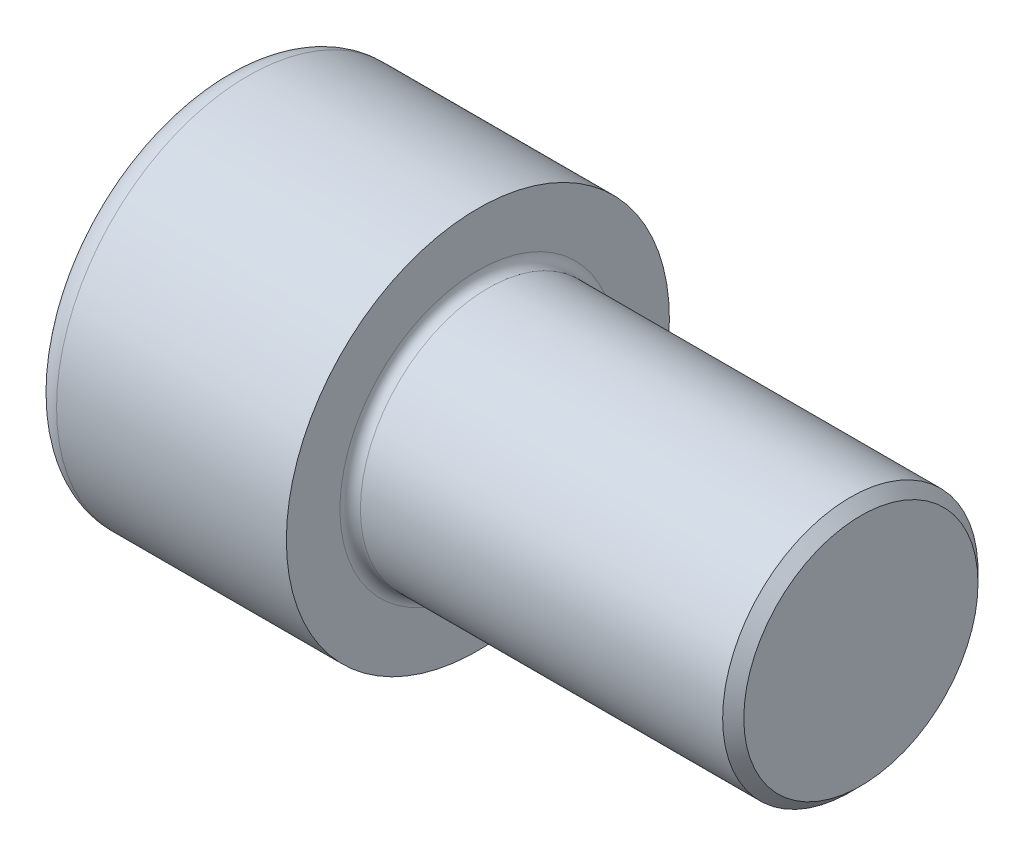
ISO-10303-21;
HEADER;
FILE_DESCRIPTION(('STEP AP214'),'2;1');
FILE_NAME('part.step','',(''),(''),'','','');
FILE_SCHEMA(('AUTOMOTIVE_DESIGN { 1 0 10303 214 1 1 1 1 }'));
ENDSEC;
DATA;
#1=APPLICATION_CONTEXT('core data for automotive mechanical design processes');
#2=APPLICATION_PROTOCOL_DEFINITION('international standard','automotive_design',2000,#1);
#3=PRODUCT_CONTEXT('',#1,'mechanical');
#4=PRODUCT('Part','Part','',(#3));
#5=PRODUCT_RELATED_PRODUCT_CATEGORY('part','',(#4));
#6=PRODUCT_DEFINITION_FORMATION('','',#4);
#7=PRODUCT_DEFINITION_CONTEXT('part definition',#1,'design');
#8=PRODUCT_DEFINITION('design','',#6,#7);
#9=PRODUCT_DEFINITION_SHAPE('','',#8);
#10=(LENGTH_UNIT() NAMED_UNIT(*) SI_UNIT(.MILLI.,.METRE.));
#11=(NAMED_UNIT(*) PLANE_ANGLE_UNIT() SI_UNIT($,.RADIAN.));
#12=(NAMED_UNIT(*) SI_UNIT($,.STERADIAN.) SOLID_ANGLE_UNIT());
#13=UNCERTAINTY_MEASURE_WITH_UNIT(LENGTH_MEASURE(1.E-05),#10,'distance_accuracy_value','');
#14=(GEOMETRIC_REPRESENTATION_CONTEXT(3) GLOBAL_UNCERTAINTY_ASSIGNED_CONTEXT((#13)) GLOBAL_UNIT_ASSIGNED_CONTEXT((#10,
#11,#12)) REPRESENTATION_CONTEXT('',''));
#15=CARTESIAN_POINT('',(0.,0.,0.));
#16=DIRECTION('',(0.,0.,1.));
#17=DIRECTION('',(1.,0.,0.));
#18=AXIS2_PLACEMENT_3D('',#15,#16,#17);
#19=CARTESIAN_POINT('',(0.,0.,0.));
#20=DIRECTION('',(-1.,0.,0.));
#21=DIRECTION('',(0.,0.,1.));
#22=AXIS2_PLACEMENT_3D('',#19,#20,#21);
#23=PLANE('',#22);
#24=DIRECTION('',(0.,-0.499999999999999,0.866025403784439));
#25=VECTOR('',#24,1.);
#26=CARTESIAN_POINT('',(0.,9.84382208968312,0.));
#27=LINE('',#26,#25);
#28=CARTESIAN_POINT('',(0.,9.84382208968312,0.));
#29=VERTEX_POINT('',#28);
#30=CARTESIAN_POINT('',(0.,4.92191104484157,8.52499999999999));
#31=VERTEX_POINT('',#30);
#32=EDGE_CURVE('E261',#29,#31,#27,.T.);
#33=ORIENTED_EDGE('',*,*,#32,.T.);
#34=DIRECTION('',(0.,1.,0.));
#35=VECTOR('',#34,1.);
#36=CARTESIAN_POINT('',(0.,-4.92191104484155,8.525));
#37=LINE('',#36,#35);
#38=CARTESIAN_POINT('',(0.,-4.92191104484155,8.525));
#39=VERTEX_POINT('',#38);
#40=EDGE_CURVE('E133',#39,#31,#37,.T.);
#41=ORIENTED_EDGE('',*,*,#40,.F.);
#42=DIRECTION('',(0.,-0.500000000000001,-0.866025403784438));
#43=VECTOR('',#42,1.);
#44=CARTESIAN_POINT('',(0.,-4.92191104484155,8.525));
#45=LINE('',#44,#43);
#46=CARTESIAN_POINT('',(0.,-9.84382208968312,0.));
#47=VERTEX_POINT('',#46);
#48=EDGE_CURVE('E264',#39,#47,#45,.T.);
#49=ORIENTED_EDGE('',*,*,#48,.T.);
#50=DIRECTION('',(0.,0.499999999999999,-0.866025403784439));
#51=VECTOR('',#50,1.);
#52=CARTESIAN_POINT('',(0.,-9.84382208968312,0.));
#53=LINE('',#52,#51);
#54=CARTESIAN_POINT('',(0.,-4.92191104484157,-8.525));
#55=VERTEX_POINT('',#54);
#56=EDGE_CURVE('E267',#47,#55,#53,.T.);
#57=ORIENTED_EDGE('',*,*,#56,.T.);
#58=DIRECTION('',(0.,-1.,0.));
#59=VECTOR('',#58,1.);
#60=CARTESIAN_POINT('',(0.,4.92191104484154,-8.52500000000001));
#61=LINE('',#60,#59);
#62=CARTESIAN_POINT('',(0.,4.92191104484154,-8.52500000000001));
#63=VERTEX_POINT('',#62);
#64=EDGE_CURVE('E270',#63,#55,#61,.T.);
#65=ORIENTED_EDGE('',*,*,#64,.F.);
#66=DIRECTION('',(0.,-0.500000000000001,-0.866025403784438));
#67=VECTOR('',#66,1.);
#68=CARTESIAN_POINT('',(0.,9.84382208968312,0.));
#69=LINE('',#68,#67);
#70=EDGE_CURVE('E128',#29,#63,#69,.T.);
#71=ORIENTED_EDGE('',*,*,#70,.F.);
#72=EDGE_LOOP('',(#33,#41,#49,#57,#65,#71));
#73=FACE_BOUND('',#72,.T.);
#74=CARTESIAN_POINT('',(0.,0.,0.));
#75=DIRECTION('',(-1.,0.,0.));
#76=DIRECTION('',(0.,0.,1.));
#77=AXIS2_PLACEMENT_3D('',#74,#75,#76);
#78=CIRCLE('',#77,13.);
#79=CARTESIAN_POINT('',(0.,0.,13.));
#80=VERTEX_POINT('',#79);
#81=EDGE_CURVE('E45',#80,#80,#78,.T.);
#82=ORIENTED_EDGE('',*,*,#81,.T.);
#83=EDGE_LOOP('',(#82));
#84=FACE_BOUND('',#83,.T.);
#85=ADVANCED_FACE('F37',(#73,#84),#23,.T.);
#86=CARTESIAN_POINT('',(-31.75,0.,0.));
#87=DIRECTION('',(-1.,0.,0.));
#88=DIRECTION('',(0.,0.,1.));
#89=AXIS2_PLACEMENT_3D('',#86,#87,#88);
#90=CYLINDRICAL_SURFACE('',#89,15.);
#91=CARTESIAN_POINT('',(2.,0.,0.));
#92=DIRECTION('',(-1.,0.,0.));
#93=DIRECTION('',(0.,0.,1.));
#94=AXIS2_PLACEMENT_3D('',#91,#92,#93);
#95=CIRCLE('',#94,15.);
#96=CARTESIAN_POINT('',(2.,0.,15.));
#97=VERTEX_POINT('',#96);
#98=EDGE_CURVE('E11',#97,#97,#95,.F.);
#99=ORIENTED_EDGE('',*,*,#98,.T.);
#100=EDGE_LOOP('',(#99));
#101=FACE_BOUND('',#100,.T.);
#102=CARTESIAN_POINT('',(20.,0.,0.));
#103=DIRECTION('',(-1.,0.,0.));
#104=DIRECTION('',(0.,0.,1.));
#105=AXIS2_PLACEMENT_3D('',#102,#103,#104);
#106=CIRCLE('',#105,15.);
#107=CARTESIAN_POINT('',(20.,0.,15.));
#108=VERTEX_POINT('',#107);
#109=EDGE_CURVE('E151',#108,#108,#106,.T.);
#110=ORIENTED_EDGE('',*,*,#109,.T.);
#111=EDGE_LOOP('',(#110));
#112=FACE_BOUND('',#111,.T.);
#113=ADVANCED_FACE('F175',(#101,#112),#90,.T.);
#114=CARTESIAN_POINT('',(20.,15.,0.));
#115=DIRECTION('',(1.,0.,0.));
#116=DIRECTION('',(0.,0.,-1.));
#117=AXIS2_PLACEMENT_3D('',#114,#115,#116);
#118=PLANE('',#117);
#119=CARTESIAN_POINT('',(20.,0.,0.));
#120=DIRECTION('',(1.,0.,0.));
#121=DIRECTION('',(0.,0.,-1.));
#122=AXIS2_PLACEMENT_3D('',#119,#120,#121);
#123=CIRCLE('',#122,10.8);
#124=CARTESIAN_POINT('',(20.,0.,-10.8));
#125=VERTEX_POINT('',#124);
#126=EDGE_CURVE('E154',#125,#125,#123,.F.);
#127=ORIENTED_EDGE('',*,*,#126,.T.);
#128=EDGE_LOOP('',(#127));
#129=FACE_BOUND('',#128,.T.);
#130=ORIENTED_EDGE('',*,*,#109,.F.);
#131=EDGE_LOOP('',(#130));
#132=FACE_BOUND('',#131,.T.);
#133=ADVANCED_FACE('F181',(#129,#132),#118,.T.);
#134=CARTESIAN_POINT('',(-31.75,0.,0.));
#135=DIRECTION('',(-1.,0.,0.));
#136=DIRECTION('',(0.,0.,1.));
#137=AXIS2_PLACEMENT_3D('',#134,#135,#136);
#138=CYLINDRICAL_SURFACE('',#137,10.);
#139=CARTESIAN_POINT('',(20.8,0.,0.));
#140=DIRECTION('',(1.,0.,0.));
#141=DIRECTION('',(0.,0.,-1.));
#142=AXIS2_PLACEMENT_3D('',#139,#140,#141);
#143=CIRCLE('',#142,10.);
#144=CARTESIAN_POINT('',(20.8,0.,-10.));
#145=VERTEX_POINT('',#144);
#146=EDGE_CURVE('E157',#145,#145,#143,.T.);
#147=ORIENTED_EDGE('',*,*,#146,.T.);
#148=EDGE_LOOP('',(#147));
#149=FACE_BOUND('',#148,.T.);
#150=CARTESIAN_POINT('',(49.172,0.,0.));
#151=DIRECTION('',(-1.,0.,0.));
#152=DIRECTION('',(0.,0.,1.));
#153=AXIS2_PLACEMENT_3D('',#150,#151,#152);
#154=CIRCLE('',#153,10.);
#155=CARTESIAN_POINT('',(49.172,0.,10.));
#156=VERTEX_POINT('',#155);
#157=EDGE_CURVE('E148',#156,#156,#154,.T.);
#158=ORIENTED_EDGE('',*,*,#157,.T.);
#159=EDGE_LOOP('',(#158));
#160=FACE_BOUND('',#159,.T.);
#161=ADVANCED_FACE('F187',(#149,#160),#138,.T.);
#162=CARTESIAN_POINT('',(50.,0.,0.));
#163=DIRECTION('',(-1.,0.,0.));
#164=DIRECTION('',(0.,0.,1.));
#165=AXIS2_PLACEMENT_3D('',#162,#163,#164);
#166=CONICAL_SURFACE('',#165,9.172,0.78539816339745);
#167=ORIENTED_EDGE('',*,*,#157,.F.);
#168=EDGE_LOOP('',(#167));
#169=FACE_BOUND('',#168,.T.);
#170=CARTESIAN_POINT('',(50.,0.,0.));
#171=DIRECTION('',(-1.,0.,0.));
#172=DIRECTION('',(0.,0.,1.));
#173=AXIS2_PLACEMENT_3D('',#170,#171,#172);
#174=CIRCLE('',#173,9.172);
#175=CARTESIAN_POINT('',(50.,0.,9.172));
#176=VERTEX_POINT('',#175);
#177=EDGE_CURVE('E144',#176,#176,#174,.T.);
#178=ORIENTED_EDGE('',*,*,#177,.T.);
#179=EDGE_LOOP('',(#178));
#180=FACE_BOUND('',#179,.T.);
#181=ADVANCED_FACE('F191',(#169,#180),#166,.T.);
#182=CARTESIAN_POINT('',(50.,9.172,0.));
#183=DIRECTION('',(1.,0.,0.));
#184=DIRECTION('',(0.,0.,-1.));
#185=AXIS2_PLACEMENT_3D('',#182,#183,#184);
#186=PLANE('',#185);
#187=ORIENTED_EDGE('',*,*,#177,.F.);
#188=EDGE_LOOP('',(#187));
#189=FACE_BOUND('',#188,.T.);
#190=ADVANCED_FACE('F171',(#189),#186,.T.);
#191=CARTESIAN_POINT('',(20.8,0.,0.));
#192=DIRECTION('',(1.,0.,0.));
#193=DIRECTION('',(0.,0.,-1.));
#194=AXIS2_PLACEMENT_3D('',#191,#192,#193);
#195=TOROIDAL_SURFACE('',#194,10.8,0.8);
#196=ORIENTED_EDGE('',*,*,#146,.F.);
#197=EDGE_LOOP('',(#196));
#198=FACE_BOUND('',#197,.T.);
#199=ORIENTED_EDGE('',*,*,#126,.F.);
#200=EDGE_LOOP('',(#199));
#201=FACE_BOUND('',#200,.T.);
#202=ADVANCED_FACE('F164',(#198,#201),#195,.F.);
#203=CARTESIAN_POINT('',(2.,0.,0.));
#204=DIRECTION('',(-1.,0.,0.));
#205=DIRECTION('',(0.,0.,1.));
#206=AXIS2_PLACEMENT_3D('',#203,#204,#205);
#207=TOROIDAL_SURFACE('',#206,13.,2.);
#208=ORIENTED_EDGE('',*,*,#98,.F.);
#209=EDGE_LOOP('',(#208));
#210=FACE_BOUND('',#209,.T.);
#211=ORIENTED_EDGE('',*,*,#81,.F.);
#212=EDGE_LOOP('',(#211));
#213=FACE_BOUND('',#212,.T.);
#214=ADVANCED_FACE('F39',(#210,#213),#207,.T.);
#215=CARTESIAN_POINT('',(10.,9.84382208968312,0.));
#216=DIRECTION('',(0.,-0.866025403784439,-0.499999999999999));
#217=DIRECTION('',(0.,0.499999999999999,-0.866025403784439));
#218=AXIS2_PLACEMENT_3D('',#215,#216,#217);
#219=PLANE('',#218);
#220=ORIENTED_EDGE('',*,*,#32,.F.);
#221=DIRECTION('',(-1.,0.,0.));
#222=VECTOR('',#221,1.);
#223=CARTESIAN_POINT('',(10.,9.84382208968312,0.));
#224=LINE('',#223,#222);
#225=CARTESIAN_POINT('',(10.,9.84382208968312,0.));
#226=VERTEX_POINT('',#225);
#227=EDGE_CURVE('E251',#226,#29,#224,.T.);
#228=ORIENTED_EDGE('',*,*,#227,.F.);
#229=DIRECTION('',(0.,-0.499999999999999,0.866025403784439));
#230=VECTOR('',#229,1.);
#231=CARTESIAN_POINT('',(10.,9.84382208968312,0.));
#232=LINE('',#231,#230);
#233=CARTESIAN_POINT('',(10.,7.38286656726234,4.26249999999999));
#234=VERTEX_POINT('',#233);
#235=EDGE_CURVE('E120',#226,#234,#232,.T.);
#236=ORIENTED_EDGE('',*,*,#235,.T.);
#237=CARTESIAN_POINT('',(10.,4.92191104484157,8.52499999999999));
#238=VERTEX_POINT('',#237);
#239=EDGE_CURVE('E111',#234,#238,#232,.T.);
#240=ORIENTED_EDGE('',*,*,#239,.T.);
#241=DIRECTION('',(-1.,0.,0.));
#242=VECTOR('',#241,1.);
#243=CARTESIAN_POINT('',(10.,4.92191104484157,8.52499999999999));
#244=LINE('',#243,#242);
#245=EDGE_CURVE('E125',#238,#31,#244,.T.);
#246=ORIENTED_EDGE('',*,*,#245,.T.);
#247=EDGE_LOOP('',(#220,#228,#236,#240,#246));
#248=FACE_BOUND('',#247,.T.);
#249=ADVANCED_FACE('F124',(#248),#219,.T.);
#250=CARTESIAN_POINT('',(10.,-4.92191104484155,8.525));
#251=DIRECTION('',(0.,0.,1.));
#252=DIRECTION('',(0.,-1.,0.));
#253=AXIS2_PLACEMENT_3D('',#250,#251,#252);
#254=PLANE('',#253);
#255=ORIENTED_EDGE('',*,*,#40,.T.);
#256=ORIENTED_EDGE('',*,*,#245,.F.);
#257=DIRECTION('',(0.,1.,0.));
#258=VECTOR('',#257,1.);
#259=CARTESIAN_POINT('',(10.,-4.92191104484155,8.525));
#260=LINE('',#259,#258);
#261=CARTESIAN_POINT('',(10.,0.,8.525));
#262=VERTEX_POINT('',#261);
#263=EDGE_CURVE('E108',#262,#238,#260,.T.);
#264=ORIENTED_EDGE('',*,*,#263,.F.);
#265=CARTESIAN_POINT('',(10.,-4.92191104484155,8.525));
#266=VERTEX_POINT('',#265);
#267=EDGE_CURVE('E119',#266,#262,#260,.T.);
#268=ORIENTED_EDGE('',*,*,#267,.F.);
#269=DIRECTION('',(-1.,0.,0.));
#270=VECTOR('',#269,1.);
#271=CARTESIAN_POINT('',(10.,-4.92191104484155,8.525));
#272=LINE('',#271,#270);
#273=EDGE_CURVE('E135',#266,#39,#272,.T.);
#274=ORIENTED_EDGE('',*,*,#273,.T.);
#275=EDGE_LOOP('',(#255,#256,#264,#268,#274));
#276=FACE_BOUND('',#275,.T.);
#277=ADVANCED_FACE('F130',(#276),#254,.F.);
#278=CARTESIAN_POINT('',(10.,-4.92191104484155,8.525));
#279=DIRECTION('',(0.,0.866025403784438,-0.500000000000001));
#280=DIRECTION('',(0.,0.500000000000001,0.866025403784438));
#281=AXIS2_PLACEMENT_3D('',#278,#279,#280);
#282=PLANE('',#281);
#283=ORIENTED_EDGE('',*,*,#48,.F.);
#284=ORIENTED_EDGE('',*,*,#273,.F.);
#285=DIRECTION('',(0.,-0.500000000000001,-0.866025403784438));
#286=VECTOR('',#285,1.);
#287=CARTESIAN_POINT('',(10.,-4.92191104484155,8.525));
#288=LINE('',#287,#286);
#289=CARTESIAN_POINT('',(10.,-7.38286656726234,4.26250000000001));
#290=VERTEX_POINT('',#289);
#291=EDGE_CURVE('E290',#266,#290,#288,.T.);
#292=ORIENTED_EDGE('',*,*,#291,.T.);
#293=CARTESIAN_POINT('',(10.,-9.84382208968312,0.));
#294=VERTEX_POINT('',#293);
#295=EDGE_CURVE('E279',#290,#294,#288,.T.);
#296=ORIENTED_EDGE('',*,*,#295,.T.);
#297=DIRECTION('',(-1.,0.,0.));
#298=VECTOR('',#297,1.);
#299=CARTESIAN_POINT('',(10.,-9.84382208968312,0.));
#300=LINE('',#299,#298);
#301=EDGE_CURVE('E140',#294,#47,#300,.T.);
#302=ORIENTED_EDGE('',*,*,#301,.T.);
#303=EDGE_LOOP('',(#283,#284,#292,#296,#302));
#304=FACE_BOUND('',#303,.T.);
#305=ADVANCED_FACE('F205',(#304),#282,.T.);
#306=CARTESIAN_POINT('',(10.,-9.84382208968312,0.));
#307=DIRECTION('',(0.,0.866025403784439,0.499999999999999));
#308=DIRECTION('',(0.,-0.499999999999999,0.866025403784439));
#309=AXIS2_PLACEMENT_3D('',#306,#307,#308);
#310=PLANE('',#309);
#311=ORIENTED_EDGE('',*,*,#56,.F.);
#312=ORIENTED_EDGE('',*,*,#301,.F.);
#313=DIRECTION('',(0.,0.499999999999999,-0.866025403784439));
#314=VECTOR('',#313,1.);
#315=CARTESIAN_POINT('',(10.,-9.84382208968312,0.));
#316=LINE('',#315,#314);
#317=CARTESIAN_POINT('',(10.,-7.38286656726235,-4.26249999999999));
#318=VERTEX_POINT('',#317);
#319=EDGE_CURVE('E257',#294,#318,#316,.T.);
#320=ORIENTED_EDGE('',*,*,#319,.T.);
#321=CARTESIAN_POINT('',(10.,-4.92191104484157,-8.525));
#322=VERTEX_POINT('',#321);
#323=EDGE_CURVE('E289',#318,#322,#316,.T.);
#324=ORIENTED_EDGE('',*,*,#323,.T.);
#325=DIRECTION('',(-1.,0.,0.));
#326=VECTOR('',#325,1.);
#327=CARTESIAN_POINT('',(10.,-4.92191104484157,-8.525));
#328=LINE('',#327,#326);
#329=EDGE_CURVE('E250',#322,#55,#328,.T.);
#330=ORIENTED_EDGE('',*,*,#329,.T.);
#331=EDGE_LOOP('',(#311,#312,#320,#324,#330));
#332=FACE_BOUND('',#331,.T.);
#333=ADVANCED_FACE('F208',(#332),#310,.T.);
#334=CARTESIAN_POINT('',(10.,4.92191104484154,-8.52500000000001));
#335=DIRECTION('',(0.,0.,-1.));
#336=DIRECTION('',(0.,1.,0.));
#337=AXIS2_PLACEMENT_3D('',#334,#335,#336);
#338=PLANE('',#337);
#339=ORIENTED_EDGE('',*,*,#64,.T.);
#340=ORIENTED_EDGE('',*,*,#329,.F.);
#341=DIRECTION('',(0.,-1.,0.));
#342=VECTOR('',#341,1.);
#343=CARTESIAN_POINT('',(10.,4.92191104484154,-8.52500000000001));
#344=LINE('',#343,#342);
#345=CARTESIAN_POINT('',(10.,0.,-8.525));
#346=VERTEX_POINT('',#345);
#347=EDGE_CURVE('E254',#346,#322,#344,.T.);
#348=ORIENTED_EDGE('',*,*,#347,.F.);
#349=CARTESIAN_POINT('',(10.,4.92191104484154,-8.52500000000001));
#350=VERTEX_POINT('',#349);
#351=EDGE_CURVE('E52',#350,#346,#344,.T.);
#352=ORIENTED_EDGE('',*,*,#351,.F.);
#353=DIRECTION('',(-1.,0.,0.));
#354=VECTOR('',#353,1.);
#355=CARTESIAN_POINT('',(10.,4.92191104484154,-8.52500000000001));
#356=LINE('',#355,#354);
#357=EDGE_CURVE('E247',#350,#63,#356,.T.);
#358=ORIENTED_EDGE('',*,*,#357,.T.);
#359=EDGE_LOOP('',(#339,#340,#348,#352,#358));
#360=FACE_BOUND('',#359,.T.);
#361=ADVANCED_FACE('F212',(#360),#338,.F.);
#362=CARTESIAN_POINT('',(10.,9.84382208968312,0.));
#363=DIRECTION('',(0.,0.866025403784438,-0.500000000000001));
#364=DIRECTION('',(0.,0.500000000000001,0.866025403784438));
#365=AXIS2_PLACEMENT_3D('',#362,#363,#364);
#366=PLANE('',#365);
#367=ORIENTED_EDGE('',*,*,#70,.T.);
#368=ORIENTED_EDGE('',*,*,#357,.F.);
#369=DIRECTION('',(0.,-0.500000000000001,-0.866025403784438));
#370=VECTOR('',#369,1.);
#371=CARTESIAN_POINT('',(10.,9.84382208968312,0.));
#372=LINE('',#371,#370);
#373=CARTESIAN_POINT('',(10.,7.38286656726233,-4.26250000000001));
#374=VERTEX_POINT('',#373);
#375=EDGE_CURVE('E237',#374,#350,#372,.T.);
#376=ORIENTED_EDGE('',*,*,#375,.F.);
#377=EDGE_CURVE('E243',#226,#374,#372,.T.);
#378=ORIENTED_EDGE('',*,*,#377,.F.);
#379=ORIENTED_EDGE('',*,*,#227,.T.);
#380=EDGE_LOOP('',(#367,#368,#376,#378,#379));
#381=FACE_BOUND('',#380,.T.);
#382=ADVANCED_FACE('F216',(#381),#366,.F.);
#383=CARTESIAN_POINT('',(10.,9.84382208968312,0.));
#384=DIRECTION('',(1.,0.,0.));
#385=DIRECTION('',(0.,0.,-1.));
#386=AXIS2_PLACEMENT_3D('',#383,#384,#385);
#387=PLANE('',#386);
#388=ORIENTED_EDGE('',*,*,#347,.T.);
#389=ORIENTED_EDGE('',*,*,#323,.F.);
#390=CARTESIAN_POINT('',(10.,0.,0.));
#391=DIRECTION('',(-1.,0.,0.));
#392=DIRECTION('',(0.,0.,1.));
#393=AXIS2_PLACEMENT_3D('',#390,#391,#392);
#394=CIRCLE('',#393,8.525);
#395=EDGE_CURVE('E285',#346,#318,#394,.T.);
#396=ORIENTED_EDGE('',*,*,#395,.F.);
#397=EDGE_LOOP('',(#388,#389,#396));
#398=FACE_BOUND('',#397,.T.);
#399=ADVANCED_FACE('F220',(#398),#387,.F.);
#400=ORIENTED_EDGE('',*,*,#319,.F.);
#401=ORIENTED_EDGE('',*,*,#295,.F.);
#402=EDGE_CURVE('E138',#318,#290,#394,.T.);
#403=ORIENTED_EDGE('',*,*,#402,.F.);
#404=EDGE_LOOP('',(#400,#401,#403));
#405=FACE_BOUND('',#404,.T.);
#406=ADVANCED_FACE('F223',(#405),#387,.F.);
#407=ORIENTED_EDGE('',*,*,#291,.F.);
#408=ORIENTED_EDGE('',*,*,#267,.T.);
#409=EDGE_CURVE('E134',#290,#262,#394,.T.);
#410=ORIENTED_EDGE('',*,*,#409,.F.);
#411=EDGE_LOOP('',(#407,#408,#410));
#412=FACE_BOUND('',#411,.T.);
#413=ADVANCED_FACE('F228',(#412),#387,.F.);
#414=ORIENTED_EDGE('',*,*,#263,.T.);
#415=ORIENTED_EDGE('',*,*,#239,.F.);
#416=EDGE_CURVE('E114',#262,#234,#394,.T.);
#417=ORIENTED_EDGE('',*,*,#416,.F.);
#418=EDGE_LOOP('',(#414,#415,#417));
#419=FACE_BOUND('',#418,.T.);
#420=ADVANCED_FACE('F110',(#419),#387,.F.);
#421=ORIENTED_EDGE('',*,*,#235,.F.);
#422=ORIENTED_EDGE('',*,*,#377,.T.);
#423=EDGE_CURVE('E145',#234,#374,#394,.T.);
#424=ORIENTED_EDGE('',*,*,#423,.F.);
#425=EDGE_LOOP('',(#421,#422,#424));
#426=FACE_BOUND('',#425,.T.);
#427=ADVANCED_FACE('F231',(#426),#387,.F.);
#428=ORIENTED_EDGE('',*,*,#375,.T.);
#429=ORIENTED_EDGE('',*,*,#351,.T.);
#430=EDGE_CURVE('E240',#374,#346,#394,.T.);
#431=ORIENTED_EDGE('',*,*,#430,.F.);
#432=EDGE_LOOP('',(#428,#429,#431));
#433=FACE_BOUND('',#432,.T.);
#434=ADVANCED_FACE('F201',(#433),#387,.F.);
#435=CARTESIAN_POINT('',(10.,0.,0.));
#436=DIRECTION('',(-1.,0.,0.));
#437=DIRECTION('',(0.,0.,1.));
#438=AXIS2_PLACEMENT_3D('',#435,#436,#437);
#439=CONICAL_SURFACE('',#438,8.525,1.04719755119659);
#440=CARTESIAN_POINT('',(14.9219110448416,0.,0.));
#441=VERTEX_POINT('',#440);
#442=VERTEX_LOOP('',#441);
#443=FACE_BOUND('',#442,.T.);
#444=ORIENTED_EDGE('',*,*,#416,.T.);
#445=ORIENTED_EDGE('',*,*,#423,.T.);
#446=ORIENTED_EDGE('',*,*,#430,.T.);
#447=ORIENTED_EDGE('',*,*,#395,.T.);
#448=ORIENTED_EDGE('',*,*,#402,.T.);
#449=ORIENTED_EDGE('',*,*,#409,.T.);
#450=EDGE_LOOP('',(#444,#445,#446,#447,#448,#449));
#451=FACE_BOUND('',#450,.T.);
#452=ADVANCED_FACE('F199',(#443,#451),#439,.F.);
#453=CLOSED_SHELL('',(#85,#113,#133,#161,#181,#190,#202,#214,#249,#277,#305,#333,#361,#382,#399,
#406,#413,#420,#427,#434,#452));
#454=MANIFOLD_SOLID_BREP('B2',#453);
#455=ADVANCED_BREP_SHAPE_REPRESENTATION('',(#18,#454),#14);
#456=SHAPE_DEFINITION_REPRESENTATION(#9,#455);
ENDSEC;
END-ISO-10303-21;
